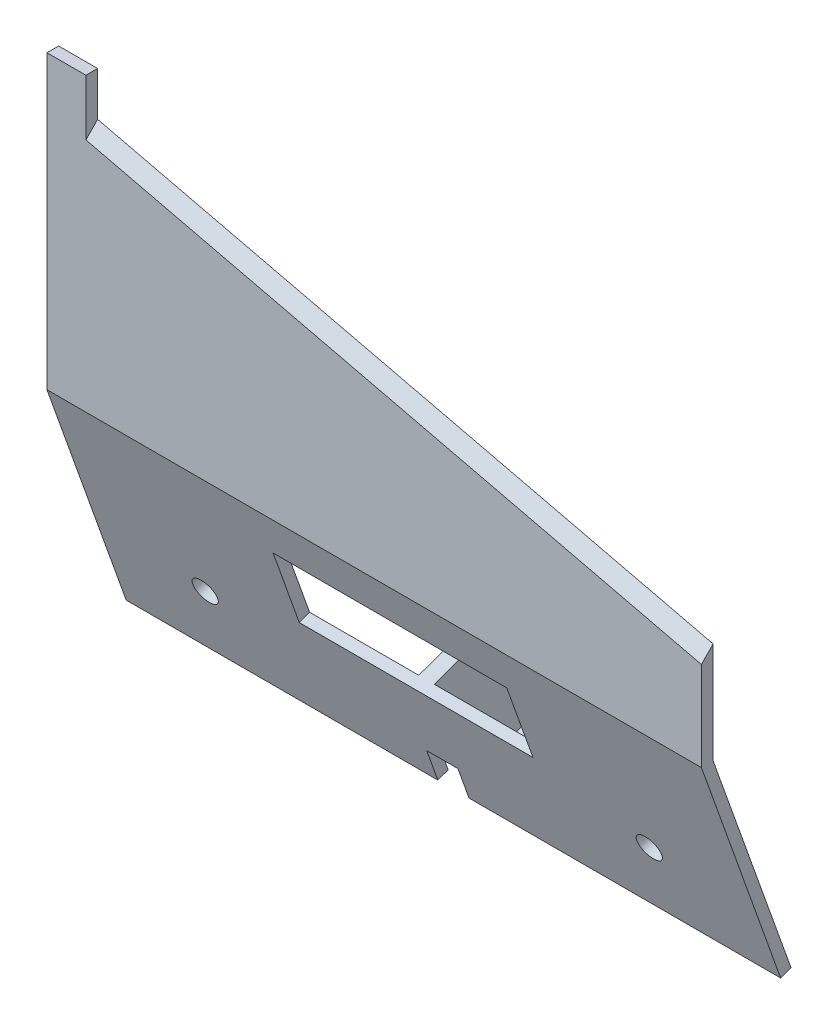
ISO-10303-21;
HEADER;
FILE_DESCRIPTION(('STEP AP214'),'2;1');
FILE_NAME('part.step','',(''),(''),'','','');
FILE_SCHEMA(('AUTOMOTIVE_DESIGN { 1 0 10303 214 1 1 1 1 }'));
ENDSEC;
DATA;
#1=APPLICATION_CONTEXT('core data for automotive mechanical design processes');
#2=APPLICATION_PROTOCOL_DEFINITION('international standard','automotive_design',2000,#1);
#3=PRODUCT_CONTEXT('',#1,'mechanical');
#4=PRODUCT('Part','Part','',(#3));
#5=PRODUCT_RELATED_PRODUCT_CATEGORY('part','',(#4));
#6=PRODUCT_DEFINITION_FORMATION('','',#4);
#7=PRODUCT_DEFINITION_CONTEXT('part definition',#1,'design');
#8=PRODUCT_DEFINITION('design','',#6,#7);
#9=PRODUCT_DEFINITION_SHAPE('','',#8);
#10=(LENGTH_UNIT() NAMED_UNIT(*) SI_UNIT(.MILLI.,.METRE.));
#11=(NAMED_UNIT(*) PLANE_ANGLE_UNIT() SI_UNIT($,.RADIAN.));
#12=(NAMED_UNIT(*) SI_UNIT($,.STERADIAN.) SOLID_ANGLE_UNIT());
#13=UNCERTAINTY_MEASURE_WITH_UNIT(LENGTH_MEASURE(1.E-05),#10,'distance_accuracy_value','');
#14=(GEOMETRIC_REPRESENTATION_CONTEXT(3) GLOBAL_UNCERTAINTY_ASSIGNED_CONTEXT((#13)) GLOBAL_UNIT_ASSIGNED_CONTEXT((#10,
#11,#12)) REPRESENTATION_CONTEXT('',''));
#15=CARTESIAN_POINT('',(0.,0.,0.));
#16=DIRECTION('',(0.,0.,1.));
#17=DIRECTION('',(1.,0.,0.));
#18=AXIS2_PLACEMENT_3D('',#15,#16,#17);
#19=CARTESIAN_POINT('',(-84.,-28.,-10.));
#20=DIRECTION('',(0.,-0.941741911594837,-0.336336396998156));
#21=DIRECTION('',(0.,0.336336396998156,-0.941741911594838));
#22=AXIS2_PLACEMENT_3D('',#19,#20,#21);
#23=PLANE('',#22);
#24=DIRECTION('',(0.,-0.336336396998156,0.941741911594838));
#25=VECTOR('',#24,1.);
#26=CARTESIAN_POINT('',(-44.,-16.7209539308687,-41.5813289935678));
#27=LINE('',#26,#25);
#28=CARTESIAN_POINT('',(-44.,-28.,-10.));
#29=VERTEX_POINT('',#28);
#30=CARTESIAN_POINT('',(-44.,-28.4751131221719,-8.66968325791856));
#31=VERTEX_POINT('',#30);
#32=EDGE_CURVE('E209',#29,#31,#27,.T.);
#33=ORIENTED_EDGE('',*,*,#32,.T.);
#34=DIRECTION('',(1.,0.,0.));
#35=VECTOR('',#34,1.);
#36=CARTESIAN_POINT('',(-84.,-28.4751131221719,-8.66968325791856));
#37=LINE('',#36,#35);
#38=CARTESIAN_POINT('',(-84.,-28.4751131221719,-8.66968325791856));
#39=VERTEX_POINT('',#38);
#40=EDGE_CURVE('E222',#39,#31,#37,.T.);
#41=ORIENTED_EDGE('',*,*,#40,.F.);
#42=DIRECTION('',(0.,0.336336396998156,-0.941741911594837));
#43=VECTOR('',#42,1.);
#44=CARTESIAN_POINT('',(-84.,-28.,-10.));
#45=LINE('',#44,#43);
#46=CARTESIAN_POINT('',(-84.,-28.,-10.));
#47=VERTEX_POINT('',#46);
#48=EDGE_CURVE('E403',#39,#47,#45,.T.);
#49=ORIENTED_EDGE('',*,*,#48,.T.);
#50=DIRECTION('',(1.,0.,0.));
#51=VECTOR('',#50,1.);
#52=CARTESIAN_POINT('',(-84.,-28.,-10.));
#53=LINE('',#52,#51);
#54=EDGE_CURVE('E224',#47,#29,#53,.T.);
#55=ORIENTED_EDGE('',*,*,#54,.T.);
#56=EDGE_LOOP('',(#33,#41,#49,#55));
#57=FACE_BOUND('',#56,.T.);
#58=ADVANCED_FACE('F32',(#57),#23,.T.);
#59=CARTESIAN_POINT('',(0.,0.,1.5));
#60=DIRECTION('',(-1.,0.,0.));
#61=DIRECTION('',(0.,0.,1.));
#62=AXIS2_PLACEMENT_3D('',#59,#60,#61);
#63=PLANE('',#62);
#64=DIRECTION('',(0.,1.,0.));
#65=VECTOR('',#64,1.);
#66=CARTESIAN_POINT('',(0.,0.,0.));
#67=LINE('',#66,#65);
#68=CARTESIAN_POINT('',(0.,0.,0.));
#69=VERTEX_POINT('',#68);
#70=CARTESIAN_POINT('',(0.,13.,0.));
#71=VERTEX_POINT('',#70);
#72=EDGE_CURVE('E243',#69,#71,#67,.T.);
#73=ORIENTED_EDGE('',*,*,#72,.T.);
#74=DIRECTION('',(0.,-0.716785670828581,0.697293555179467));
#75=VECTOR('',#74,1.);
#76=CARTESIAN_POINT('',(0.,11.142245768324,1.80723486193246));
#77=LINE('',#76,#75);
#78=CARTESIAN_POINT('',(0.,11.4580690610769,1.5));
#79=VERTEX_POINT('',#78);
#80=EDGE_CURVE('E40',#71,#79,#77,.T.);
#81=ORIENTED_EDGE('',*,*,#80,.T.);
#82=DIRECTION('',(0.,1.,0.));
#83=VECTOR('',#82,1.);
#84=CARTESIAN_POINT('',(0.,0.,1.5));
#85=LINE('',#84,#83);
#86=CARTESIAN_POINT('',(0.,0.,1.5));
#87=VERTEX_POINT('',#86);
#88=EDGE_CURVE('E253',#87,#79,#85,.T.);
#89=ORIENTED_EDGE('',*,*,#88,.F.);
#90=DIRECTION('',(0.,-0.941741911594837,-0.336336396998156));
#91=VECTOR('',#90,1.);
#92=CARTESIAN_POINT('',(0.,0.,1.5));
#93=LINE('',#92,#91);
#94=CARTESIAN_POINT('',(0.,-28.4751131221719,-8.66968325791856));
#95=VERTEX_POINT('',#94);
#96=EDGE_CURVE('E395',#87,#95,#93,.T.);
#97=ORIENTED_EDGE('',*,*,#96,.T.);
#98=DIRECTION('',(0.,0.336336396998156,-0.941741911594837));
#99=VECTOR('',#98,1.);
#100=CARTESIAN_POINT('',(0.,-28.,-10.));
#101=LINE('',#100,#99);
#102=CARTESIAN_POINT('',(0.,-28.,-10.));
#103=VERTEX_POINT('',#102);
#104=EDGE_CURVE('E397',#95,#103,#101,.T.);
#105=ORIENTED_EDGE('',*,*,#104,.T.);
#106=DIRECTION('',(0.,0.941741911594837,0.336336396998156));
#107=VECTOR('',#106,1.);
#108=CARTESIAN_POINT('',(0.,0.,0.));
#109=LINE('',#108,#107);
#110=EDGE_CURVE('E400',#103,#69,#109,.T.);
#111=ORIENTED_EDGE('',*,*,#110,.T.);
#112=EDGE_LOOP('',(#73,#81,#89,#97,#105,#111));
#113=FACE_BOUND('',#112,.T.);
#114=ADVANCED_FACE('F34',(#113),#63,.F.);
#115=CARTESIAN_POINT('',(-84.,33.,1.5));
#116=DIRECTION('',(1.,0.,0.));
#117=DIRECTION('',(0.,0.,-1.));
#118=AXIS2_PLACEMENT_3D('',#115,#116,#117);
#119=PLANE('',#118);
#120=DIRECTION('',(0.,-0.941741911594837,-0.336336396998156));
#121=VECTOR('',#120,1.);
#122=CARTESIAN_POINT('',(-84.,0.,1.5));
#123=LINE('',#122,#121);
#124=CARTESIAN_POINT('',(-84.,0.,1.5));
#125=VERTEX_POINT('',#124);
#126=EDGE_CURVE('E232',#125,#39,#123,.T.);
#127=ORIENTED_EDGE('',*,*,#126,.F.);
#128=DIRECTION('',(0.,-1.,0.));
#129=VECTOR('',#128,1.);
#130=CARTESIAN_POINT('',(-84.,33.,1.5));
#131=LINE('',#130,#129);
#132=CARTESIAN_POINT('',(-84.,37.4580690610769,1.5));
#133=VERTEX_POINT('',#132);
#134=EDGE_CURVE('E256',#133,#125,#131,.T.);
#135=ORIENTED_EDGE('',*,*,#134,.F.);
#136=DIRECTION('',(0.,0.,1.));
#137=VECTOR('',#136,1.);
#138=CARTESIAN_POINT('',(-84.,37.4580690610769,0.));
#139=LINE('',#138,#137);
#140=CARTESIAN_POINT('',(-84.,37.4580690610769,0.));
#141=VERTEX_POINT('',#140);
#142=EDGE_CURVE('E293',#141,#133,#139,.T.);
#143=ORIENTED_EDGE('',*,*,#142,.F.);
#144=DIRECTION('',(0.,-1.,0.));
#145=VECTOR('',#144,1.);
#146=CARTESIAN_POINT('',(-84.,33.,0.));
#147=LINE('',#146,#145);
#148=CARTESIAN_POINT('',(-84.,0.,0.));
#149=VERTEX_POINT('',#148);
#150=EDGE_CURVE('E248',#141,#149,#147,.T.);
#151=ORIENTED_EDGE('',*,*,#150,.T.);
#152=DIRECTION('',(0.,0.941741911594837,0.336336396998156));
#153=VECTOR('',#152,1.);
#154=CARTESIAN_POINT('',(-84.,0.,0.));
#155=LINE('',#154,#153);
#156=EDGE_CURVE('E237',#47,#149,#155,.T.);
#157=ORIENTED_EDGE('',*,*,#156,.F.);
#158=ORIENTED_EDGE('',*,*,#48,.F.);
#159=EDGE_LOOP('',(#127,#135,#143,#151,#157,#158));
#160=FACE_BOUND('',#159,.T.);
#161=ADVANCED_FACE('F412',(#160),#119,.F.);
#162=CARTESIAN_POINT('',(0.,0.,1.5));
#163=DIRECTION('',(0.,0.,1.));
#164=DIRECTION('',(1.,0.,0.));
#165=AXIS2_PLACEMENT_3D('',#162,#163,#164);
#166=PLANE('',#165);
#167=DIRECTION('',(-0.972806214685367,0.23162052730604,0.));
#168=VECTOR('',#167,1.);
#169=CARTESIAN_POINT('',(-84.3474307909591,31.540790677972,1.5));
#170=LINE('',#169,#168);
#171=CARTESIAN_POINT('',(-79.,30.2675928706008,1.5));
#172=VERTEX_POINT('',#171);
#173=EDGE_CURVE('E258',#79,#172,#170,.T.);
#174=ORIENTED_EDGE('',*,*,#173,.T.);
#175=DIRECTION('',(0.,1.,0.));
#176=VECTOR('',#175,1.);
#177=CARTESIAN_POINT('',(-79.,27.5657221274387,1.5));
#178=LINE('',#177,#176);
#179=CARTESIAN_POINT('',(-79.,37.4580690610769,1.5));
#180=VERTEX_POINT('',#179);
#181=EDGE_CURVE('E279',#172,#180,#178,.T.);
#182=ORIENTED_EDGE('',*,*,#181,.T.);
#183=DIRECTION('',(-1.,0.,0.));
#184=VECTOR('',#183,1.);
#185=CARTESIAN_POINT('',(-84.,37.4580690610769,1.5));
#186=LINE('',#185,#184);
#187=EDGE_CURVE('E285',#180,#133,#186,.T.);
#188=ORIENTED_EDGE('',*,*,#187,.T.);
#189=ORIENTED_EDGE('',*,*,#134,.T.);
#190=DIRECTION('',(1.,0.,0.));
#191=VECTOR('',#190,1.);
#192=CARTESIAN_POINT('',(-84.,0.,1.5));
#193=LINE('',#192,#191);
#194=EDGE_CURVE('E250',#125,#87,#193,.T.);
#195=ORIENTED_EDGE('',*,*,#194,.T.);
#196=ORIENTED_EDGE('',*,*,#88,.T.);
#197=EDGE_LOOP('',(#174,#182,#188,#189,#195,#196));
#198=FACE_BOUND('',#197,.T.);
#199=ADVANCED_FACE('F269',(#198),#166,.T.);
#200=CARTESIAN_POINT('',(0.,0.,0.));
#201=DIRECTION('',(0.,0.,1.));
#202=DIRECTION('',(1.,0.,0.));
#203=AXIS2_PLACEMENT_3D('',#200,#201,#202);
#204=PLANE('',#203);
#205=DIRECTION('',(0.,1.,0.));
#206=VECTOR('',#205,1.);
#207=CARTESIAN_POINT('',(-79.,27.5657221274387,0.));
#208=LINE('',#207,#206);
#209=CARTESIAN_POINT('',(-79.,31.8095238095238,0.));
#210=VERTEX_POINT('',#209);
#211=CARTESIAN_POINT('',(-79.,37.4580690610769,0.));
#212=VERTEX_POINT('',#211);
#213=EDGE_CURVE('E277',#210,#212,#208,.T.);
#214=ORIENTED_EDGE('',*,*,#213,.F.);
#215=DIRECTION('',(-0.972806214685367,0.23162052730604,0.));
#216=VECTOR('',#215,1.);
#217=CARTESIAN_POINT('',(0.,13.,0.));
#218=LINE('',#217,#216);
#219=EDGE_CURVE('E245',#71,#210,#218,.T.);
#220=ORIENTED_EDGE('',*,*,#219,.F.);
#221=ORIENTED_EDGE('',*,*,#72,.F.);
#222=DIRECTION('',(1.,0.,0.));
#223=VECTOR('',#222,1.);
#224=CARTESIAN_POINT('',(-84.,0.,0.));
#225=LINE('',#224,#223);
#226=EDGE_CURVE('E240',#149,#69,#225,.T.);
#227=ORIENTED_EDGE('',*,*,#226,.F.);
#228=ORIENTED_EDGE('',*,*,#150,.F.);
#229=DIRECTION('',(-1.,0.,0.));
#230=VECTOR('',#229,1.);
#231=CARTESIAN_POINT('',(-84.,37.4580690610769,0.));
#232=LINE('',#231,#230);
#233=EDGE_CURVE('E284',#212,#141,#232,.T.);
#234=ORIENTED_EDGE('',*,*,#233,.F.);
#235=EDGE_LOOP('',(#214,#220,#221,#227,#228,#234));
#236=FACE_BOUND('',#235,.T.);
#237=ADVANCED_FACE('F282',(#236),#204,.F.);
#238=CARTESIAN_POINT('',(-84.,0.,0.));
#239=DIRECTION('',(0.,0.336336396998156,-0.941741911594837));
#240=DIRECTION('',(0.,0.941741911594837,0.336336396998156));
#241=AXIS2_PLACEMENT_3D('',#238,#239,#240);
#242=PLANE('',#241);
#243=CARTESIAN_POINT('',(-70.5,-18.5825808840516,-6.63663603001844));
#244=DIRECTION('',(0.,0.336336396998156,-0.941741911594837));
#245=DIRECTION('',(0.,0.941741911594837,0.336336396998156));
#246=AXIS2_PLACEMENT_3D('',#243,#244,#245);
#247=CIRCLE('',#246,1.59999999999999);
#248=CARTESIAN_POINT('',(-70.5,-17.0757938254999,-6.09849779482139));
#249=VERTEX_POINT('',#248);
#250=EDGE_CURVE('E437',#249,#249,#247,.T.);
#251=ORIENTED_EDGE('',*,*,#250,.F.);
#252=EDGE_LOOP('',(#251));
#253=FACE_BOUND('',#252,.T.);
#254=CARTESIAN_POINT('',(-13.5,-18.5825808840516,-6.63663603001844));
#255=DIRECTION('',(0.,0.336336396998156,-0.941741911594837));
#256=DIRECTION('',(0.,0.941741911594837,0.336336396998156));
#257=AXIS2_PLACEMENT_3D('',#254,#255,#256);
#258=CIRCLE('',#257,1.6);
#259=CARTESIAN_POINT('',(-13.5,-17.0757938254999,-6.09849779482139));
#260=VERTEX_POINT('',#259);
#261=EDGE_CURVE('E225',#260,#260,#258,.T.);
#262=ORIENTED_EDGE('',*,*,#261,.F.);
#263=EDGE_LOOP('',(#262));
#264=FACE_BOUND('',#263,.T.);
#265=DIRECTION('',(0.,-0.941741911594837,-0.336336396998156));
#266=VECTOR('',#265,1.);
#267=CARTESIAN_POINT('',(-44.,-28.2480151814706,-10.0885768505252));
#268=LINE('',#267,#266);
#269=CARTESIAN_POINT('',(-44.,-24.0101765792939,-8.57506306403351));
#270=VERTEX_POINT('',#269);
#271=EDGE_CURVE('E429',#270,#29,#268,.T.);
#272=ORIENTED_EDGE('',*,*,#271,.T.);
#273=ORIENTED_EDGE('',*,*,#54,.F.);
#274=ORIENTED_EDGE('',*,*,#156,.T.);
#275=ORIENTED_EDGE('',*,*,#226,.T.);
#276=ORIENTED_EDGE('',*,*,#110,.F.);
#277=CARTESIAN_POINT('',(-40.,-28.,-10.));
#278=VERTEX_POINT('',#277);
#279=EDGE_CURVE('E233',#278,#103,#53,.T.);
#280=ORIENTED_EDGE('',*,*,#279,.F.);
#281=DIRECTION('',(0.,0.941741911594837,0.336336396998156));
#282=VECTOR('',#281,1.);
#283=CARTESIAN_POINT('',(-40.,-28.2480151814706,-10.0885768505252));
#284=LINE('',#283,#282);
#285=CARTESIAN_POINT('',(-40.,-24.0101765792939,-8.57506306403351));
#286=VERTEX_POINT('',#285);
#287=EDGE_CURVE('E426',#278,#286,#284,.T.);
#288=ORIENTED_EDGE('',*,*,#287,.T.);
#289=DIRECTION('',(-1.,0.,0.));
#290=VECTOR('',#289,1.);
#291=CARTESIAN_POINT('',(-44.,-24.0101765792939,-8.57506306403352));
#292=LINE('',#291,#290);
#293=EDGE_CURVE('E417',#286,#270,#292,.T.);
#294=ORIENTED_EDGE('',*,*,#293,.T.);
#295=EDGE_LOOP('',(#272,#273,#274,#275,#276,#280,#288,#294));
#296=FACE_BOUND('',#295,.T.);
#297=DIRECTION('',(0.,-0.941741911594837,-0.336336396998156));
#298=VECTOR('',#297,1.);
#299=CARTESIAN_POINT('',(-41.,-14.5927574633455,-5.21169909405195));
#300=LINE('',#299,#298);
#301=CARTESIAN_POINT('',(-41.,-14.5927574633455,-5.21169909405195));
#302=VERTEX_POINT('',#301);
#303=CARTESIAN_POINT('',(-41.,-23.068434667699,-8.23872666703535));
#304=VERTEX_POINT('',#303);
#305=EDGE_CURVE('E316',#302,#304,#300,.T.);
#306=ORIENTED_EDGE('',*,*,#305,.F.);
#307=DIRECTION('',(-1.,0.,0.));
#308=VECTOR('',#307,1.);
#309=CARTESIAN_POINT('',(-84.,-14.5927574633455,-5.21169909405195));
#310=LINE('',#309,#308);
#311=CARTESIAN_POINT('',(-27.,-14.5927574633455,-5.21169909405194));
#312=VERTEX_POINT('',#311);
#313=EDGE_CURVE('E390',#312,#302,#310,.T.);
#314=ORIENTED_EDGE('',*,*,#313,.F.);
#315=DIRECTION('',(0.,-0.941741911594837,-0.336336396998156));
#316=VECTOR('',#315,1.);
#317=CARTESIAN_POINT('',(-27.,0.,0.));
#318=LINE('',#317,#316);
#319=CARTESIAN_POINT('',(-27.,-5.17533834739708,-1.84833512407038));
#320=VERTEX_POINT('',#319);
#321=EDGE_CURVE('E393',#320,#312,#318,.T.);
#322=ORIENTED_EDGE('',*,*,#321,.F.);
#323=DIRECTION('',(1.,0.,0.));
#324=VECTOR('',#323,1.);
#325=CARTESIAN_POINT('',(-84.,-5.17533834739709,-1.84833512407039));
#326=LINE('',#325,#324);
#327=CARTESIAN_POINT('',(-57.,-5.17533834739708,-1.84833512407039));
#328=VERTEX_POINT('',#327);
#329=EDGE_CURVE('E378',#328,#320,#326,.T.);
#330=ORIENTED_EDGE('',*,*,#329,.F.);
#331=DIRECTION('',(0.,0.941741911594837,0.336336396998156));
#332=VECTOR('',#331,1.);
#333=CARTESIAN_POINT('',(-57.,0.,0.));
#334=LINE('',#333,#332);
#335=CARTESIAN_POINT('',(-57.,-14.5927574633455,-5.21169909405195));
#336=VERTEX_POINT('',#335);
#337=EDGE_CURVE('E386',#336,#328,#334,.T.);
#338=ORIENTED_EDGE('',*,*,#337,.F.);
#339=CARTESIAN_POINT('',(-43.,-14.5927574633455,-5.21169909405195));
#340=VERTEX_POINT('',#339);
#341=EDGE_CURVE('E389',#340,#336,#310,.T.);
#342=ORIENTED_EDGE('',*,*,#341,.F.);
#343=DIRECTION('',(0.,-0.941741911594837,-0.336336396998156));
#344=VECTOR('',#343,1.);
#345=CARTESIAN_POINT('',(-43.,-14.5927574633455,-5.21169909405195));
#346=LINE('',#345,#344);
#347=CARTESIAN_POINT('',(-43.,-23.068434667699,-8.23872666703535));
#348=VERTEX_POINT('',#347);
#349=EDGE_CURVE('E55',#340,#348,#346,.T.);
#350=ORIENTED_EDGE('',*,*,#349,.T.);
#351=DIRECTION('',(-1.,0.,0.));
#352=VECTOR('',#351,1.);
#353=CARTESIAN_POINT('',(-41.,-23.068434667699,-8.23872666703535));
#354=LINE('',#353,#352);
#355=EDGE_CURVE('E361',#304,#348,#354,.T.);
#356=ORIENTED_EDGE('',*,*,#355,.F.);
#357=EDGE_LOOP('',(#306,#314,#322,#330,#338,#342,#350,#356));
#358=FACE_BOUND('',#357,.T.);
#359=ADVANCED_FACE('F407',(#253,#264,#296,#358),#242,.T.);
#360=DIRECTION('',(0.,0.336336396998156,-0.941741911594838));
#361=VECTOR('',#360,1.);
#362=CARTESIAN_POINT('',(-40.,-16.7209539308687,-41.5813289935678));
#363=LINE('',#362,#361);
#364=CARTESIAN_POINT('',(-40.,-28.4751131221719,-8.66968325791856));
#365=VERTEX_POINT('',#364);
#366=EDGE_CURVE('E47',#365,#278,#363,.T.);
#367=ORIENTED_EDGE('',*,*,#366,.T.);
#368=ORIENTED_EDGE('',*,*,#279,.T.);
#369=ORIENTED_EDGE('',*,*,#104,.F.);
#370=EDGE_CURVE('E234',#365,#95,#37,.T.);
#371=ORIENTED_EDGE('',*,*,#370,.F.);
#372=EDGE_LOOP('',(#367,#368,#369,#371));
#373=FACE_BOUND('',#372,.T.);
#374=ADVANCED_FACE('F448',(#373),#23,.T.);
#375=CARTESIAN_POINT('',(-84.,0.,1.5));
#376=DIRECTION('',(0.,-0.336336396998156,0.941741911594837));
#377=DIRECTION('',(0.,-0.941741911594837,-0.336336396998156));
#378=AXIS2_PLACEMENT_3D('',#375,#376,#377);
#379=PLANE('',#378);
#380=CARTESIAN_POINT('',(-70.5,-19.0576940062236,-5.30631928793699));
#381=DIRECTION('',(0.,-0.336336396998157,0.941741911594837));
#382=DIRECTION('',(0.,-0.941741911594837,-0.336336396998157));
#383=AXIS2_PLACEMENT_3D('',#380,#381,#382);
#384=CIRCLE('',#383,1.59999999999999);
#385=CARTESIAN_POINT('',(-70.5,-20.5644810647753,-5.84445752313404));
#386=VERTEX_POINT('',#385);
#387=EDGE_CURVE('E440',#386,#386,#384,.T.);
#388=ORIENTED_EDGE('',*,*,#387,.F.);
#389=EDGE_LOOP('',(#388));
#390=FACE_BOUND('',#389,.T.);
#391=CARTESIAN_POINT('',(-13.5,-19.0576940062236,-5.306319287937));
#392=DIRECTION('',(0.,-0.336336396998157,0.941741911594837));
#393=DIRECTION('',(0.,-0.941741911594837,-0.336336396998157));
#394=AXIS2_PLACEMENT_3D('',#391,#392,#393);
#395=CIRCLE('',#394,1.6);
#396=CARTESIAN_POINT('',(-13.5,-20.5644810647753,-5.84445752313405));
#397=VERTEX_POINT('',#396);
#398=EDGE_CURVE('E434',#397,#397,#395,.T.);
#399=ORIENTED_EDGE('',*,*,#398,.F.);
#400=EDGE_LOOP('',(#399));
#401=FACE_BOUND('',#400,.T.);
#402=DIRECTION('',(0.,-0.941741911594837,-0.336336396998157));
#403=VECTOR('',#402,1.);
#404=CARTESIAN_POINT('',(-44.,-28.7231283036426,-8.75826010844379));
#405=LINE('',#404,#403);
#406=CARTESIAN_POINT('',(-44.,-24.4852897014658,-7.24474632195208));
#407=VERTEX_POINT('',#406);
#408=EDGE_CURVE('E205',#407,#31,#405,.T.);
#409=ORIENTED_EDGE('',*,*,#408,.F.);
#410=DIRECTION('',(-1.,0.,0.));
#411=VECTOR('',#410,1.);
#412=CARTESIAN_POINT('',(-44.,-24.4852897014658,-7.24474632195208));
#413=LINE('',#412,#411);
#414=CARTESIAN_POINT('',(-40.,-24.4852897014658,-7.24474632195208));
#415=VERTEX_POINT('',#414);
#416=EDGE_CURVE('E217',#415,#407,#413,.T.);
#417=ORIENTED_EDGE('',*,*,#416,.F.);
#418=DIRECTION('',(0.,0.941741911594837,0.336336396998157));
#419=VECTOR('',#418,1.);
#420=CARTESIAN_POINT('',(-40.,-28.7231283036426,-8.75826010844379));
#421=LINE('',#420,#419);
#422=EDGE_CURVE('E424',#365,#415,#421,.T.);
#423=ORIENTED_EDGE('',*,*,#422,.F.);
#424=ORIENTED_EDGE('',*,*,#370,.T.);
#425=ORIENTED_EDGE('',*,*,#96,.F.);
#426=ORIENTED_EDGE('',*,*,#194,.F.);
#427=ORIENTED_EDGE('',*,*,#126,.T.);
#428=ORIENTED_EDGE('',*,*,#40,.T.);
#429=EDGE_LOOP('',(#409,#417,#423,#424,#425,#426,#427,#428));
#430=FACE_BOUND('',#429,.T.);
#431=DIRECTION('',(0.,0.941741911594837,0.336336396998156));
#432=VECTOR('',#431,1.);
#433=CARTESIAN_POINT('',(-27.,-5.65045146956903,-0.518018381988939));
#434=LINE('',#433,#432);
#435=CARTESIAN_POINT('',(-27.,-15.0678705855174,-3.8813823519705));
#436=VERTEX_POINT('',#435);
#437=CARTESIAN_POINT('',(-27.,-5.65045146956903,-0.518018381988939));
#438=VERTEX_POINT('',#437);
#439=EDGE_CURVE('E364',#436,#438,#434,.T.);
#440=ORIENTED_EDGE('',*,*,#439,.F.);
#441=DIRECTION('',(1.,0.,0.));
#442=VECTOR('',#441,1.);
#443=CARTESIAN_POINT('',(-27.,-15.0678705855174,-3.8813823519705));
#444=LINE('',#443,#442);
#445=CARTESIAN_POINT('',(-57.,-15.0678705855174,-3.8813823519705));
#446=VERTEX_POINT('',#445);
#447=EDGE_CURVE('E372',#446,#436,#444,.T.);
#448=ORIENTED_EDGE('',*,*,#447,.F.);
#449=DIRECTION('',(0.,-0.941741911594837,-0.336336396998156));
#450=VECTOR('',#449,1.);
#451=CARTESIAN_POINT('',(-57.,-5.65045146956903,-0.51801838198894));
#452=LINE('',#451,#450);
#453=CARTESIAN_POINT('',(-57.,-5.65045146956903,-0.51801838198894));
#454=VERTEX_POINT('',#453);
#455=EDGE_CURVE('E369',#454,#446,#452,.T.);
#456=ORIENTED_EDGE('',*,*,#455,.F.);
#457=DIRECTION('',(-1.,0.,0.));
#458=VECTOR('',#457,1.);
#459=CARTESIAN_POINT('',(-27.,-5.65045146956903,-0.518018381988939));
#460=LINE('',#459,#458);
#461=EDGE_CURVE('E366',#438,#454,#460,.T.);
#462=ORIENTED_EDGE('',*,*,#461,.F.);
#463=EDGE_LOOP('',(#440,#448,#456,#462));
#464=FACE_BOUND('',#463,.T.);
#465=ADVANCED_FACE('F228',(#390,#401,#430,#464),#379,.T.);
#466=CARTESIAN_POINT('',(2.58175375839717,10.8433657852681,1.5));
#467=DIRECTION('',(0.163780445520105,0.687877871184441,0.707106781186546));
#468=DIRECTION('',(0.,-0.716785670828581,0.697293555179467));
#469=AXIS2_PLACEMENT_3D('',#466,#467,#468);
#470=PLANE('',#469);
#471=DIRECTION('',(0.,0.716785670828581,-0.697293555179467));
#472=VECTOR('',#471,1.);
#473=CARTESIAN_POINT('',(-79.,20.2877804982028,11.2084234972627));
#474=LINE('',#473,#472);
#475=EDGE_CURVE('E11',#172,#210,#474,.T.);
#476=ORIENTED_EDGE('',*,*,#475,.F.);
#477=ORIENTED_EDGE('',*,*,#173,.F.);
#478=ORIENTED_EDGE('',*,*,#80,.F.);
#479=ORIENTED_EDGE('',*,*,#219,.T.);
#480=EDGE_LOOP('',(#476,#477,#478,#479));
#481=FACE_BOUND('',#480,.T.);
#482=ADVANCED_FACE('F272',(#481),#470,.T.);
#483=CARTESIAN_POINT('',(-27.,1.72511414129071,-21.1696020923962));
#484=DIRECTION('',(1.,0.,0.));
#485=DIRECTION('',(0.,0.,-1.));
#486=AXIS2_PLACEMENT_3D('',#483,#484,#485);
#487=PLANE('',#486);
#488=ORIENTED_EDGE('',*,*,#321,.T.);
#489=DIRECTION('',(0.,-0.336336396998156,0.941741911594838));
#490=VECTOR('',#489,1.);
#491=CARTESIAN_POINT('',(-27.,-7.69230497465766,-24.5329660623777));
#492=LINE('',#491,#490);
#493=EDGE_CURVE('E376',#312,#436,#492,.T.);
#494=ORIENTED_EDGE('',*,*,#493,.T.);
#495=ORIENTED_EDGE('',*,*,#439,.T.);
#496=DIRECTION('',(0.,-0.336336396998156,0.941741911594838));
#497=VECTOR('',#496,1.);
#498=CARTESIAN_POINT('',(-27.,1.72511414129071,-21.1696020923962));
#499=LINE('',#498,#497);
#500=EDGE_CURVE('E375',#320,#438,#499,.T.);
#501=ORIENTED_EDGE('',*,*,#500,.F.);
#502=EDGE_LOOP('',(#488,#494,#495,#501));
#503=FACE_BOUND('',#502,.T.);
#504=ADVANCED_FACE('F537',(#503),#487,.F.);
#505=CARTESIAN_POINT('',(-27.,-7.69230497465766,-24.5329660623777));
#506=DIRECTION('',(0.,-0.941741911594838,-0.336336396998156));
#507=DIRECTION('',(0.,0.336336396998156,-0.941741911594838));
#508=AXIS2_PLACEMENT_3D('',#505,#506,#507);
#509=PLANE('',#508);
#510=ORIENTED_EDGE('',*,*,#313,.T.);
#511=DIRECTION('',(0.,-0.336336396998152,0.941741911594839));
#512=VECTOR('',#511,1.);
#513=CARTESIAN_POINT('',(-41.,-14.5927574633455,-5.21169909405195));
#514=LINE('',#513,#512);
#515=CARTESIAN_POINT('',(-41.,-10.5567206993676,-16.51260203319));
#516=VERTEX_POINT('',#515);
#517=EDGE_CURVE('E335',#516,#302,#514,.T.);
#518=ORIENTED_EDGE('',*,*,#517,.F.);
#519=DIRECTION('',(-1.,0.,0.));
#520=VECTOR('',#519,1.);
#521=CARTESIAN_POINT('',(-41.,-10.5567206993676,-16.51260203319));
#522=LINE('',#521,#520);
#523=CARTESIAN_POINT('',(-43.,-10.5567206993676,-16.51260203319));
#524=VERTEX_POINT('',#523);
#525=EDGE_CURVE('E337',#516,#524,#522,.T.);
#526=ORIENTED_EDGE('',*,*,#525,.T.);
#527=DIRECTION('',(0.,-0.336336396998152,0.941741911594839));
#528=VECTOR('',#527,1.);
#529=CARTESIAN_POINT('',(-43.,-14.5927574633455,-5.21169909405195));
#530=LINE('',#529,#528);
#531=EDGE_CURVE('E314',#524,#340,#530,.T.);
#532=ORIENTED_EDGE('',*,*,#531,.T.);
#533=ORIENTED_EDGE('',*,*,#341,.T.);
#534=DIRECTION('',(0.,-0.336336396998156,0.941741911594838));
#535=VECTOR('',#534,1.);
#536=CARTESIAN_POINT('',(-57.,-7.69230497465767,-24.5329660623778));
#537=LINE('',#536,#535);
#538=EDGE_CURVE('E379',#336,#446,#537,.T.);
#539=ORIENTED_EDGE('',*,*,#538,.T.);
#540=ORIENTED_EDGE('',*,*,#447,.T.);
#541=ORIENTED_EDGE('',*,*,#493,.F.);
#542=EDGE_LOOP('',(#510,#518,#526,#532,#533,#539,#540,#541));
#543=FACE_BOUND('',#542,.T.);
#544=ADVANCED_FACE('F533',(#543),#509,.F.);
#545=CARTESIAN_POINT('',(-57.,1.7251141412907,-21.1696020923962));
#546=DIRECTION('',(-1.,0.,0.));
#547=DIRECTION('',(0.,-1.,0.));
#548=AXIS2_PLACEMENT_3D('',#545,#546,#547);
#549=PLANE('',#548);
#550=ORIENTED_EDGE('',*,*,#337,.T.);
#551=DIRECTION('',(0.,-0.336336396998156,0.941741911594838));
#552=VECTOR('',#551,1.);
#553=CARTESIAN_POINT('',(-57.,1.7251141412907,-21.1696020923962));
#554=LINE('',#553,#552);
#555=EDGE_CURVE('E381',#328,#454,#554,.T.);
#556=ORIENTED_EDGE('',*,*,#555,.T.);
#557=ORIENTED_EDGE('',*,*,#455,.T.);
#558=ORIENTED_EDGE('',*,*,#538,.F.);
#559=EDGE_LOOP('',(#550,#556,#557,#558));
#560=FACE_BOUND('',#559,.T.);
#561=ADVANCED_FACE('F536',(#560),#549,.F.);
#562=CARTESIAN_POINT('',(-27.,1.72511414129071,-21.1696020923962));
#563=DIRECTION('',(0.,0.941741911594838,0.336336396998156));
#564=DIRECTION('',(0.,-0.336336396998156,0.941741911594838));
#565=AXIS2_PLACEMENT_3D('',#562,#563,#564);
#566=PLANE('',#565);
#567=ORIENTED_EDGE('',*,*,#329,.T.);
#568=ORIENTED_EDGE('',*,*,#500,.T.);
#569=ORIENTED_EDGE('',*,*,#461,.T.);
#570=ORIENTED_EDGE('',*,*,#555,.F.);
#571=EDGE_LOOP('',(#567,#568,#569,#570));
#572=FACE_BOUND('',#571,.T.);
#573=ADVANCED_FACE('F531',(#572),#566,.F.);
#574=CARTESIAN_POINT('',(-41.,-23.068434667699,-8.23872666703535));
#575=DIRECTION('',(0.,0.941741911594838,0.336336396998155));
#576=DIRECTION('',(0.,-0.336336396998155,0.941741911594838));
#577=AXIS2_PLACEMENT_3D('',#574,#575,#576);
#578=PLANE('',#577);
#579=DIRECTION('',(0.,0.336336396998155,-0.941741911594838));
#580=VECTOR('',#579,1.);
#581=CARTESIAN_POINT('',(-43.,-23.068434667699,-8.23872666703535));
#582=LINE('',#581,#580);
#583=CARTESIAN_POINT('',(-43.,-22.0594254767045,-11.0639524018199));
#584=VERTEX_POINT('',#583);
#585=EDGE_CURVE('E298',#348,#584,#582,.T.);
#586=ORIENTED_EDGE('',*,*,#585,.T.);
#587=DIRECTION('',(-1.,0.,0.));
#588=VECTOR('',#587,1.);
#589=CARTESIAN_POINT('',(-41.,-22.0594254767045,-11.0639524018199));
#590=LINE('',#589,#588);
#591=CARTESIAN_POINT('',(-41.,-22.0594254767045,-11.0639524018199));
#592=VERTEX_POINT('',#591);
#593=EDGE_CURVE('E358',#592,#584,#590,.T.);
#594=ORIENTED_EDGE('',*,*,#593,.F.);
#595=DIRECTION('',(0.,0.336336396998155,-0.941741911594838));
#596=VECTOR('',#595,1.);
#597=CARTESIAN_POINT('',(-41.,-23.068434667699,-8.23872666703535));
#598=LINE('',#597,#596);
#599=EDGE_CURVE('E319',#304,#592,#598,.T.);
#600=ORIENTED_EDGE('',*,*,#599,.F.);
#601=ORIENTED_EDGE('',*,*,#355,.T.);
#602=EDGE_LOOP('',(#586,#594,#600,#601));
#603=FACE_BOUND('',#602,.T.);
#604=ADVANCED_FACE('F527',(#603),#578,.F.);
#605=CARTESIAN_POINT('',(-41.,-22.0594254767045,-11.0639524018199));
#606=DIRECTION('',(0.,0.721988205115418,-0.691905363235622));
#607=DIRECTION('',(0.,0.691905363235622,0.721988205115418));
#608=AXIS2_PLACEMENT_3D('',#605,#606,#607);
#609=PLANE('',#608);
#610=DIRECTION('',(0.,-0.691905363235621,-0.721988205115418));
#611=VECTOR('',#610,1.);
#612=CARTESIAN_POINT('',(-43.,-22.0594254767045,-11.0639524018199));
#613=LINE('',#612,#611);
#614=CARTESIAN_POINT('',(-43.,-25.5405071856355,-14.6963854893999));
#615=VERTEX_POINT('',#614);
#616=EDGE_CURVE('E300',#584,#615,#613,.T.);
#617=ORIENTED_EDGE('',*,*,#616,.T.);
#618=DIRECTION('',(-1.,0.,0.));
#619=VECTOR('',#618,1.);
#620=CARTESIAN_POINT('',(-41.,-25.5405071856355,-14.6963854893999));
#621=LINE('',#620,#619);
#622=CARTESIAN_POINT('',(-41.,-25.5405071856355,-14.6963854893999));
#623=VERTEX_POINT('',#622);
#624=EDGE_CURVE('E355',#623,#615,#621,.T.);
#625=ORIENTED_EDGE('',*,*,#624,.F.);
#626=DIRECTION('',(0.,-0.691905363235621,-0.721988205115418));
#627=VECTOR('',#626,1.);
#628=CARTESIAN_POINT('',(-41.,-22.0594254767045,-11.0639524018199));
#629=LINE('',#628,#627);
#630=EDGE_CURVE('E321',#592,#623,#629,.T.);
#631=ORIENTED_EDGE('',*,*,#630,.F.);
#632=ORIENTED_EDGE('',*,*,#593,.T.);
#633=EDGE_LOOP('',(#617,#625,#631,#632));
#634=FACE_BOUND('',#633,.T.);
#635=ADVANCED_FACE('F523',(#634),#609,.F.);
#636=CARTESIAN_POINT('',(-41.,-24.4474138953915,-17.7570467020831));
#637=DIRECTION('',(0.,0.941741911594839,0.336336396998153));
#638=DIRECTION('',(0.,-0.336336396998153,0.941741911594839));
#639=AXIS2_PLACEMENT_3D('',#636,#637,#638);
#640=PLANE('',#639);
#641=DIRECTION('',(0.,0.336336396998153,-0.941741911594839));
#642=VECTOR('',#641,1.);
#643=CARTESIAN_POINT('',(-43.,-24.4474138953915,-17.7570467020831));
#644=LINE('',#643,#642);
#645=CARTESIAN_POINT('',(-43.,-24.4474138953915,-17.7570467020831));
#646=VERTEX_POINT('',#645);
#647=EDGE_CURVE('E302',#615,#646,#644,.T.);
#648=ORIENTED_EDGE('',*,*,#647,.T.);
#649=DIRECTION('',(-1.,0.,0.));
#650=VECTOR('',#649,1.);
#651=CARTESIAN_POINT('',(-41.,-24.4474138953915,-17.7570467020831));
#652=LINE('',#651,#650);
#653=CARTESIAN_POINT('',(-41.,-24.4474138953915,-17.7570467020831));
#654=VERTEX_POINT('',#653);
#655=EDGE_CURVE('E352',#654,#646,#652,.T.);
#656=ORIENTED_EDGE('',*,*,#655,.F.);
#657=DIRECTION('',(0.,0.336336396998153,-0.941741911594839));
#658=VECTOR('',#657,1.);
#659=CARTESIAN_POINT('',(-41.,-24.4474138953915,-17.7570467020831));
#660=LINE('',#659,#658);
#661=EDGE_CURVE('E323',#623,#654,#660,.T.);
#662=ORIENTED_EDGE('',*,*,#661,.F.);
#663=ORIENTED_EDGE('',*,*,#624,.T.);
#664=EDGE_LOOP('',(#648,#656,#662,#663));
#665=FACE_BOUND('',#664,.T.);
#666=ADVANCED_FACE('F519',(#665),#640,.F.);
#667=CARTESIAN_POINT('',(-41.,-25.3891558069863,-18.0933830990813));
#668=DIRECTION('',(-1.,0.,0.));
#669=DIRECTION('',(0.,0.,1.));
#670=AXIS2_PLACEMENT_3D('',#667,#668,#669);
#671=CYLINDRICAL_SURFACE('',#670,1.00000000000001);
#672=CARTESIAN_POINT('',(-43.,-25.3891558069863,-18.0933830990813));
#673=DIRECTION('',(-1.,0.,0.));
#674=DIRECTION('',(0.,0.,-1.));
#675=AXIS2_PLACEMENT_3D('',#672,#673,#674);
#676=CIRCLE('',#675,1.00000000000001);
#677=CARTESIAN_POINT('',(-43.,-26.3308977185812,-18.4297194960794));
#678=VERTEX_POINT('',#677);
#679=EDGE_CURVE('E304',#646,#678,#676,.T.);
#680=ORIENTED_EDGE('',*,*,#679,.T.);
#681=DIRECTION('',(-1.,0.,0.));
#682=VECTOR('',#681,1.);
#683=CARTESIAN_POINT('',(-41.,-26.3308977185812,-18.4297194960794));
#684=LINE('',#683,#682);
#685=CARTESIAN_POINT('',(-41.,-26.3308977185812,-18.4297194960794));
#686=VERTEX_POINT('',#685);
#687=EDGE_CURVE('E349',#686,#678,#684,.T.);
#688=ORIENTED_EDGE('',*,*,#687,.F.);
#689=CARTESIAN_POINT('',(-41.,-25.3891558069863,-18.0933830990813));
#690=DIRECTION('',(-1.,0.,0.));
#691=DIRECTION('',(0.,0.,-1.));
#692=AXIS2_PLACEMENT_3D('',#689,#690,#691);
#693=CIRCLE('',#692,1.00000000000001);
#694=EDGE_CURVE('E325',#654,#686,#693,.T.);
#695=ORIENTED_EDGE('',*,*,#694,.F.);
#696=ORIENTED_EDGE('',*,*,#655,.T.);
#697=EDGE_LOOP('',(#680,#688,#695,#696));
#698=FACE_BOUND('',#697,.T.);
#699=ADVANCED_FACE('F515',(#698),#671,.F.);
#700=CARTESIAN_POINT('',(-41.,-26.3308977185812,-18.4297194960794));
#701=DIRECTION('',(0.,-0.941741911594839,-0.336336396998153));
#702=DIRECTION('',(0.,0.336336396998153,-0.941741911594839));
#703=AXIS2_PLACEMENT_3D('',#700,#701,#702);
#704=PLANE('',#703);
#705=DIRECTION('',(0.,-0.336336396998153,0.941741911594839));
#706=VECTOR('',#705,1.);
#707=CARTESIAN_POINT('',(-43.,-26.3308977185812,-18.4297194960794));
#708=LINE('',#707,#706);
#709=CARTESIAN_POINT('',(-43.,-27.087654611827,-16.3108001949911));
#710=VERTEX_POINT('',#709);
#711=EDGE_CURVE('E306',#678,#710,#708,.T.);
#712=ORIENTED_EDGE('',*,*,#711,.T.);
#713=DIRECTION('',(-1.,0.,0.));
#714=VECTOR('',#713,1.);
#715=CARTESIAN_POINT('',(-41.,-27.087654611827,-16.3108001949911));
#716=LINE('',#715,#714);
#717=CARTESIAN_POINT('',(-41.,-27.087654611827,-16.3108001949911));
#718=VERTEX_POINT('',#717);
#719=EDGE_CURVE('E346',#718,#710,#716,.T.);
#720=ORIENTED_EDGE('',*,*,#719,.F.);
#721=DIRECTION('',(0.,-0.336336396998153,0.941741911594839));
#722=VECTOR('',#721,1.);
#723=CARTESIAN_POINT('',(-41.,-26.3308977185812,-18.4297194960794));
#724=LINE('',#723,#722);
#725=EDGE_CURVE('E327',#686,#718,#724,.T.);
#726=ORIENTED_EDGE('',*,*,#725,.F.);
#727=ORIENTED_EDGE('',*,*,#687,.T.);
#728=EDGE_LOOP('',(#712,#720,#726,#727));
#729=FACE_BOUND('',#728,.T.);
#730=ADVANCED_FACE('F511',(#729),#704,.F.);
#731=CARTESIAN_POINT('',(-41.,-27.087654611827,-16.3108001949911));
#732=DIRECTION('',(0.,0.721988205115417,-0.691905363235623));
#733=DIRECTION('',(0.,0.691905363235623,0.721988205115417));
#734=AXIS2_PLACEMENT_3D('',#731,#732,#733);
#735=PLANE('',#734);
#736=DIRECTION('',(0.,-0.691905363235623,-0.721988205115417));
#737=VECTOR('',#736,1.);
#738=CARTESIAN_POINT('',(-43.,-27.087654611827,-16.3108001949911));
#739=LINE('',#738,#737);
#740=CARTESIAN_POINT('',(-43.,-28.2480151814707,-17.5216112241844));
#741=VERTEX_POINT('',#740);
#742=EDGE_CURVE('E308',#710,#741,#739,.T.);
#743=ORIENTED_EDGE('',*,*,#742,.T.);
#744=DIRECTION('',(-1.,0.,0.));
#745=VECTOR('',#744,1.);
#746=CARTESIAN_POINT('',(-41.,-28.2480151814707,-17.5216112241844));
#747=LINE('',#746,#745);
#748=CARTESIAN_POINT('',(-41.,-28.2480151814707,-17.5216112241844));
#749=VERTEX_POINT('',#748);
#750=EDGE_CURVE('E343',#749,#741,#747,.T.);
#751=ORIENTED_EDGE('',*,*,#750,.F.);
#752=DIRECTION('',(0.,-0.691905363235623,-0.721988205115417));
#753=VECTOR('',#752,1.);
#754=CARTESIAN_POINT('',(-41.,-27.087654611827,-16.3108001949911));
#755=LINE('',#754,#753);
#756=EDGE_CURVE('E329',#718,#749,#755,.T.);
#757=ORIENTED_EDGE('',*,*,#756,.F.);
#758=ORIENTED_EDGE('',*,*,#719,.T.);
#759=EDGE_LOOP('',(#743,#751,#757,#758));
#760=FACE_BOUND('',#759,.T.);
#761=ADVANCED_FACE('F507',(#760),#735,.F.);
#762=CARTESIAN_POINT('',(-41.,-26.5663331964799,-22.2303207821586));
#763=DIRECTION('',(0.,0.941741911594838,0.336336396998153));
#764=DIRECTION('',(0.,-0.336336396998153,0.941741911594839));
#765=AXIS2_PLACEMENT_3D('',#762,#763,#764);
#766=PLANE('',#765);
#767=DIRECTION('',(0.,0.336336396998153,-0.941741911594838));
#768=VECTOR('',#767,1.);
#769=CARTESIAN_POINT('',(-43.,-26.5663331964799,-22.2303207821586));
#770=LINE('',#769,#768);
#771=CARTESIAN_POINT('',(-43.,-26.5663331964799,-22.2303207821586));
#772=VERTEX_POINT('',#771);
#773=EDGE_CURVE('E310',#741,#772,#770,.T.);
#774=ORIENTED_EDGE('',*,*,#773,.T.);
#775=DIRECTION('',(-1.,0.,0.));
#776=VECTOR('',#775,1.);
#777=CARTESIAN_POINT('',(-41.,-26.5663331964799,-22.2303207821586));
#778=LINE('',#777,#776);
#779=CARTESIAN_POINT('',(-41.,-26.5663331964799,-22.2303207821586));
#780=VERTEX_POINT('',#779);
#781=EDGE_CURVE('E340',#780,#772,#778,.T.);
#782=ORIENTED_EDGE('',*,*,#781,.F.);
#783=DIRECTION('',(0.,0.336336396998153,-0.941741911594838));
#784=VECTOR('',#783,1.);
#785=CARTESIAN_POINT('',(-41.,-26.5663331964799,-22.2303207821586));
#786=LINE('',#785,#784);
#787=EDGE_CURVE('E331',#749,#780,#786,.T.);
#788=ORIENTED_EDGE('',*,*,#787,.F.);
#789=ORIENTED_EDGE('',*,*,#750,.T.);
#790=EDGE_LOOP('',(#774,#782,#788,#789));
#791=FACE_BOUND('',#790,.T.);
#792=ADVANCED_FACE('F503',(#791),#766,.F.);
#793=CARTESIAN_POINT('',(-41.,-10.5567206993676,-16.51260203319));
#794=DIRECTION('',(0.,-0.336336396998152,0.941741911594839));
#795=DIRECTION('',(0.,-0.941741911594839,-0.336336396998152));
#796=AXIS2_PLACEMENT_3D('',#793,#794,#795);
#797=PLANE('',#796);
#798=DIRECTION('',(0.,0.941741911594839,0.336336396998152));
#799=VECTOR('',#798,1.);
#800=CARTESIAN_POINT('',(-43.,-10.5567206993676,-16.51260203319));
#801=LINE('',#800,#799);
#802=EDGE_CURVE('E312',#772,#524,#801,.T.);
#803=ORIENTED_EDGE('',*,*,#802,.T.);
#804=ORIENTED_EDGE('',*,*,#525,.F.);
#805=DIRECTION('',(0.,0.941741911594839,0.336336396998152));
#806=VECTOR('',#805,1.);
#807=CARTESIAN_POINT('',(-41.,-10.5567206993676,-16.51260203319));
#808=LINE('',#807,#806);
#809=EDGE_CURVE('E333',#780,#516,#808,.T.);
#810=ORIENTED_EDGE('',*,*,#809,.F.);
#811=ORIENTED_EDGE('',*,*,#781,.T.);
#812=EDGE_LOOP('',(#803,#804,#810,#811));
#813=FACE_BOUND('',#812,.T.);
#814=ADVANCED_FACE('F499',(#813),#797,.F.);
#815=CARTESIAN_POINT('',(-41.,-25.3891558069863,-18.0933830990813));
#816=DIRECTION('',(1.,0.,0.));
#817=DIRECTION('',(0.,0.,-1.));
#818=AXIS2_PLACEMENT_3D('',#815,#816,#817);
#819=PLANE('',#818);
#820=ORIENTED_EDGE('',*,*,#305,.T.);
#821=ORIENTED_EDGE('',*,*,#599,.T.);
#822=ORIENTED_EDGE('',*,*,#630,.T.);
#823=ORIENTED_EDGE('',*,*,#661,.T.);
#824=ORIENTED_EDGE('',*,*,#694,.T.);
#825=ORIENTED_EDGE('',*,*,#725,.T.);
#826=ORIENTED_EDGE('',*,*,#756,.T.);
#827=ORIENTED_EDGE('',*,*,#787,.T.);
#828=ORIENTED_EDGE('',*,*,#809,.T.);
#829=ORIENTED_EDGE('',*,*,#517,.T.);
#830=EDGE_LOOP('',(#820,#821,#822,#823,#824,#825,#826,#827,#828,#829));
#831=FACE_BOUND('',#830,.T.);
#832=ADVANCED_FACE('F496',(#831),#819,.T.);
#833=CARTESIAN_POINT('',(-43.,-25.3891558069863,-18.0933830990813));
#834=DIRECTION('',(1.,0.,0.));
#835=DIRECTION('',(0.,0.,-1.));
#836=AXIS2_PLACEMENT_3D('',#833,#834,#835);
#837=PLANE('',#836);
#838=ORIENTED_EDGE('',*,*,#349,.F.);
#839=ORIENTED_EDGE('',*,*,#531,.F.);
#840=ORIENTED_EDGE('',*,*,#802,.F.);
#841=ORIENTED_EDGE('',*,*,#773,.F.);
#842=ORIENTED_EDGE('',*,*,#742,.F.);
#843=ORIENTED_EDGE('',*,*,#711,.F.);
#844=ORIENTED_EDGE('',*,*,#679,.F.);
#845=ORIENTED_EDGE('',*,*,#647,.F.);
#846=ORIENTED_EDGE('',*,*,#616,.F.);
#847=ORIENTED_EDGE('',*,*,#585,.F.);
#848=EDGE_LOOP('',(#838,#839,#840,#841,#842,#843,#844,#845,#846,#847));
#849=FACE_BOUND('',#848,.T.);
#850=ADVANCED_FACE('F492',(#849),#837,.F.);
#851=CARTESIAN_POINT('',(-84.,37.4580690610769,0.));
#852=DIRECTION('',(0.,1.,0.));
#853=DIRECTION('',(0.,0.,1.));
#854=AXIS2_PLACEMENT_3D('',#851,#852,#853);
#855=PLANE('',#854);
#856=ORIENTED_EDGE('',*,*,#187,.F.);
#857=DIRECTION('',(0.,0.,1.));
#858=VECTOR('',#857,1.);
#859=CARTESIAN_POINT('',(-79.,37.4580690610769,0.));
#860=LINE('',#859,#858);
#861=EDGE_CURVE('E287',#212,#180,#860,.T.);
#862=ORIENTED_EDGE('',*,*,#861,.F.);
#863=ORIENTED_EDGE('',*,*,#233,.T.);
#864=ORIENTED_EDGE('',*,*,#142,.T.);
#865=EDGE_LOOP('',(#856,#862,#863,#864));
#866=FACE_BOUND('',#865,.T.);
#867=ADVANCED_FACE('F416',(#866),#855,.T.);
#868=CARTESIAN_POINT('',(-79.,27.5657221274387,0.));
#869=DIRECTION('',(1.,0.,0.));
#870=DIRECTION('',(0.,0.,-1.));
#871=AXIS2_PLACEMENT_3D('',#868,#869,#870);
#872=PLANE('',#871);
#873=ORIENTED_EDGE('',*,*,#181,.F.);
#874=ORIENTED_EDGE('',*,*,#475,.T.);
#875=ORIENTED_EDGE('',*,*,#213,.T.);
#876=ORIENTED_EDGE('',*,*,#861,.T.);
#877=EDGE_LOOP('',(#873,#874,#875,#876));
#878=FACE_BOUND('',#877,.T.);
#879=ADVANCED_FACE('F275',(#878),#872,.T.);
#880=CARTESIAN_POINT('',(-44.,-12.7311305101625,-40.1563920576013));
#881=DIRECTION('',(0.,0.941741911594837,0.336336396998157));
#882=DIRECTION('',(0.,-0.336336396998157,0.941741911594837));
#883=AXIS2_PLACEMENT_3D('',#880,#881,#882);
#884=PLANE('',#883);
#885=DIRECTION('',(0.,-0.336336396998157,0.941741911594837));
#886=VECTOR('',#885,1.);
#887=CARTESIAN_POINT('',(-40.,-12.7311305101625,-40.1563920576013));
#888=LINE('',#887,#886);
#889=EDGE_CURVE('E216',#286,#415,#888,.T.);
#890=ORIENTED_EDGE('',*,*,#889,.T.);
#891=ORIENTED_EDGE('',*,*,#416,.T.);
#892=DIRECTION('',(0.,-0.336336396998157,0.941741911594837));
#893=VECTOR('',#892,1.);
#894=CARTESIAN_POINT('',(-44.,-12.7311305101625,-40.1563920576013));
#895=LINE('',#894,#893);
#896=EDGE_CURVE('E211',#270,#407,#895,.T.);
#897=ORIENTED_EDGE('',*,*,#896,.F.);
#898=ORIENTED_EDGE('',*,*,#293,.F.);
#899=EDGE_LOOP('',(#890,#891,#897,#898));
#900=FACE_BOUND('',#899,.T.);
#901=ADVANCED_FACE('F482',(#900),#884,.F.);
#902=CARTESIAN_POINT('',(-44.,-16.9689691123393,-41.669905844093));
#903=DIRECTION('',(-1.,0.,0.));
#904=DIRECTION('',(0.,0.,1.));
#905=AXIS2_PLACEMENT_3D('',#902,#903,#904);
#906=PLANE('',#905);
#907=ORIENTED_EDGE('',*,*,#896,.T.);
#908=ORIENTED_EDGE('',*,*,#408,.T.);
#909=ORIENTED_EDGE('',*,*,#32,.F.);
#910=ORIENTED_EDGE('',*,*,#271,.F.);
#911=EDGE_LOOP('',(#907,#908,#909,#910));
#912=FACE_BOUND('',#911,.T.);
#913=ADVANCED_FACE('F207',(#912),#906,.F.);
#914=CARTESIAN_POINT('',(-40.,-16.9689691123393,-41.669905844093));
#915=DIRECTION('',(1.,0.,0.));
#916=DIRECTION('',(0.,0.,-1.));
#917=AXIS2_PLACEMENT_3D('',#914,#915,#916);
#918=PLANE('',#917);
#919=ORIENTED_EDGE('',*,*,#366,.F.);
#920=ORIENTED_EDGE('',*,*,#422,.T.);
#921=ORIENTED_EDGE('',*,*,#889,.F.);
#922=ORIENTED_EDGE('',*,*,#287,.F.);
#923=EDGE_LOOP('',(#919,#920,#921,#922));
#924=FACE_BOUND('',#923,.T.);
#925=ADVANCED_FACE('F454',(#924),#918,.F.);
#926=CARTESIAN_POINT('',(-13.5,-7.30396467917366,-38.2167614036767));
#927=DIRECTION('',(0.,-0.336336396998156,0.941741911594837));
#928=DIRECTION('',(0.,-0.941741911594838,-0.336336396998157));
#929=AXIS2_PLACEMENT_3D('',#926,#927,#928);
#930=CYLINDRICAL_SURFACE('',#929,1.6);
#931=ORIENTED_EDGE('',*,*,#261,.T.);
#932=EDGE_LOOP('',(#931));
#933=FACE_BOUND('',#932,.T.);
#934=ORIENTED_EDGE('',*,*,#398,.T.);
#935=EDGE_LOOP('',(#934));
#936=FACE_BOUND('',#935,.T.);
#937=ADVANCED_FACE('F452',(#933,#936),#930,.F.);
#938=CARTESIAN_POINT('',(-70.5,-7.30396467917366,-38.2167614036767));
#939=DIRECTION('',(0.,-0.336336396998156,0.941741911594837));
#940=DIRECTION('',(0.,-0.941741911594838,-0.336336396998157));
#941=AXIS2_PLACEMENT_3D('',#938,#939,#940);
#942=CYLINDRICAL_SURFACE('',#941,1.59999999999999);
#943=ORIENTED_EDGE('',*,*,#250,.T.);
#944=EDGE_LOOP('',(#943));
#945=FACE_BOUND('',#944,.T.);
#946=ORIENTED_EDGE('',*,*,#387,.T.);
#947=EDGE_LOOP('',(#946));
#948=FACE_BOUND('',#947,.T.);
#949=ADVANCED_FACE('F444',(#945,#948),#942,.F.);
#950=CLOSED_SHELL('',(#58,#114,#161,#199,#237,#359,#374,#465,#482,#504,#544,#561,#573,#604,#635,
#666,#699,#730,#761,#792,#814,#832,#850,#867,#879,#901,#913,#925,#937,#949));
#951=MANIFOLD_SOLID_BREP('B2',#950);
#952=ADVANCED_BREP_SHAPE_REPRESENTATION('',(#18,#951),#14);
#953=SHAPE_DEFINITION_REPRESENTATION(#9,#952);
ENDSEC;
END-ISO-10303-21;
